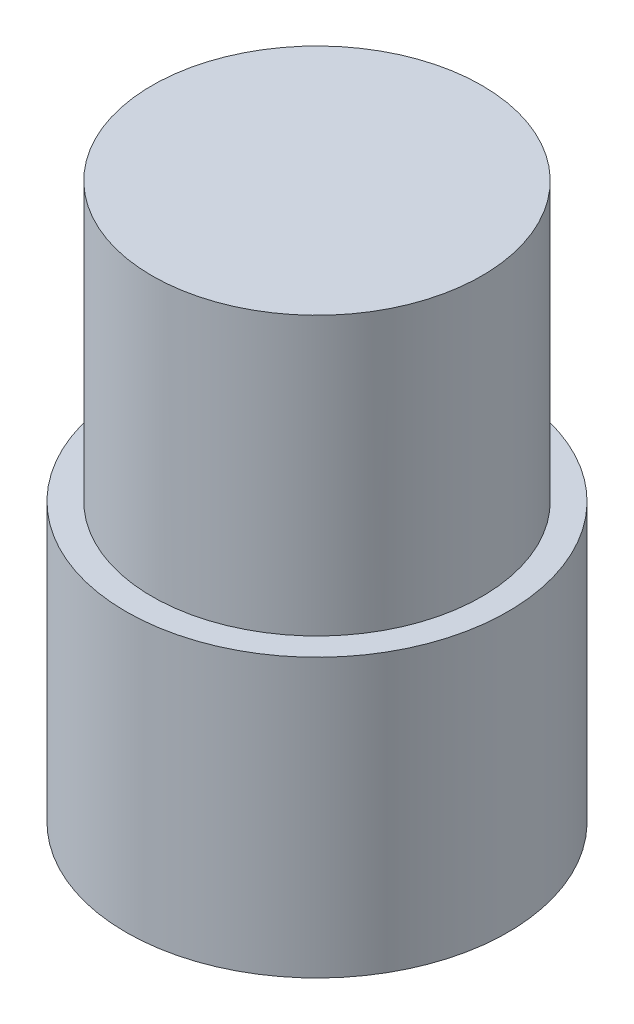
ISO-10303-21;
HEADER;
FILE_DESCRIPTION(('STEP AP214'),'2;1');
FILE_NAME('part.step','',(''),(''),'','','');
FILE_SCHEMA(('AUTOMOTIVE_DESIGN { 1 0 10303 214 1 1 1 1 }'));
ENDSEC;
DATA;
#1=APPLICATION_CONTEXT('core data for automotive mechanical design processes');
#2=APPLICATION_PROTOCOL_DEFINITION('international standard','automotive_design',2000,#1);
#3=PRODUCT_CONTEXT('',#1,'mechanical');
#4=PRODUCT('Part','Part','',(#3));
#5=PRODUCT_RELATED_PRODUCT_CATEGORY('part','',(#4));
#6=PRODUCT_DEFINITION_FORMATION('','',#4);
#7=PRODUCT_DEFINITION_CONTEXT('part definition',#1,'design');
#8=PRODUCT_DEFINITION('design','',#6,#7);
#9=PRODUCT_DEFINITION_SHAPE('','',#8);
#10=(LENGTH_UNIT() NAMED_UNIT(*) SI_UNIT(.MILLI.,.METRE.));
#11=(NAMED_UNIT(*) PLANE_ANGLE_UNIT() SI_UNIT($,.RADIAN.));
#12=(NAMED_UNIT(*) SI_UNIT($,.STERADIAN.) SOLID_ANGLE_UNIT());
#13=UNCERTAINTY_MEASURE_WITH_UNIT(LENGTH_MEASURE(1.E-05),#10,'distance_accuracy_value','');
#14=(GEOMETRIC_REPRESENTATION_CONTEXT(3) GLOBAL_UNCERTAINTY_ASSIGNED_CONTEXT((#13)) GLOBAL_UNIT_ASSIGNED_CONTEXT((#10,
#11,#12)) REPRESENTATION_CONTEXT('',''));
#15=CARTESIAN_POINT('',(0.,0.,0.));
#16=DIRECTION('',(0.,0.,1.));
#17=DIRECTION('',(1.,0.,0.));
#18=AXIS2_PLACEMENT_3D('',#15,#16,#17);
#19=CARTESIAN_POINT('',(0.,2.032,0.));
#20=DIRECTION('',(0.,-1.,0.));
#21=DIRECTION('',(0.,0.,-1.));
#22=AXIS2_PLACEMENT_3D('',#19,#20,#21);
#23=CYLINDRICAL_SURFACE('',#22,1.2065);
#24=CARTESIAN_POINT('',(0.,2.032,0.));
#25=DIRECTION('',(0.,1.,0.));
#26=DIRECTION('',(0.,0.,1.));
#27=AXIS2_PLACEMENT_3D('',#24,#25,#26);
#28=CIRCLE('',#27,1.2065);
#29=CARTESIAN_POINT('',(0.,2.032,1.2065));
#30=VERTEX_POINT('',#29);
#31=EDGE_CURVE('E10',#30,#30,#28,.T.);
#32=ORIENTED_EDGE('',*,*,#31,.F.);
#33=EDGE_LOOP('',(#32));
#34=FACE_BOUND('',#33,.T.);
#35=CARTESIAN_POINT('',(0.,0.,0.));
#36=DIRECTION('',(0.,-1.,0.));
#37=DIRECTION('',(0.,0.,-1.));
#38=AXIS2_PLACEMENT_3D('',#35,#36,#37);
#39=CIRCLE('',#38,1.2065);
#40=CARTESIAN_POINT('',(0.,0.,-1.2065));
#41=VERTEX_POINT('',#40);
#42=EDGE_CURVE('E39',#41,#41,#39,.T.);
#43=ORIENTED_EDGE('',*,*,#42,.F.);
#44=EDGE_LOOP('',(#43));
#45=FACE_BOUND('',#44,.T.);
#46=ADVANCED_FACE('F33',(#34,#45),#23,.T.);
#47=CARTESIAN_POINT('',(0.,2.032,0.));
#48=DIRECTION('',(0.,1.,0.));
#49=DIRECTION('',(0.,0.,1.));
#50=AXIS2_PLACEMENT_3D('',#47,#48,#49);
#51=PLANE('',#50);
#52=ORIENTED_EDGE('',*,*,#31,.T.);
#53=EDGE_LOOP('',(#52));
#54=FACE_BOUND('',#53,.T.);
#55=ADVANCED_FACE('F57',(#54),#51,.T.);
#56=CARTESIAN_POINT('',(0.,0.,0.));
#57=DIRECTION('',(0.,-1.,0.));
#58=DIRECTION('',(0.,0.,-1.));
#59=AXIS2_PLACEMENT_3D('',#56,#57,#58);
#60=PLANE('',#59);
#61=CARTESIAN_POINT('',(0.,0.,0.));
#62=DIRECTION('',(0.,-1.,0.));
#63=DIRECTION('',(0.,0.,-1.));
#64=AXIS2_PLACEMENT_3D('',#61,#62,#63);
#65=CIRCLE('',#64,1.397);
#66=CARTESIAN_POINT('',(0.,0.,-1.397));
#67=VERTEX_POINT('',#66);
#68=EDGE_CURVE('E47',#67,#67,#65,.T.);
#69=ORIENTED_EDGE('',*,*,#68,.F.);
#70=EDGE_LOOP('',(#69));
#71=FACE_BOUND('',#70,.T.);
#72=ORIENTED_EDGE('',*,*,#42,.T.);
#73=EDGE_LOOP('',(#72));
#74=FACE_BOUND('',#73,.T.);
#75=ADVANCED_FACE('F55',(#71,#74),#60,.F.);
#76=CARTESIAN_POINT('',(0.,-2.032,0.));
#77=DIRECTION('',(0.,1.,0.));
#78=DIRECTION('',(0.,0.,1.));
#79=AXIS2_PLACEMENT_3D('',#76,#77,#78);
#80=CYLINDRICAL_SURFACE('',#79,1.397);
#81=CARTESIAN_POINT('',(0.,-2.032,0.));
#82=DIRECTION('',(0.,-1.,0.));
#83=DIRECTION('',(0.,0.,-1.));
#84=AXIS2_PLACEMENT_3D('',#81,#82,#83);
#85=CIRCLE('',#84,1.397);
#86=CARTESIAN_POINT('',(0.,-2.032,-1.397));
#87=VERTEX_POINT('',#86);
#88=EDGE_CURVE('E43',#87,#87,#85,.T.);
#89=ORIENTED_EDGE('',*,*,#88,.F.);
#90=EDGE_LOOP('',(#89));
#91=FACE_BOUND('',#90,.T.);
#92=ORIENTED_EDGE('',*,*,#68,.T.);
#93=EDGE_LOOP('',(#92));
#94=FACE_BOUND('',#93,.T.);
#95=ADVANCED_FACE('F53',(#91,#94),#80,.T.);
#96=CARTESIAN_POINT('',(0.,-2.032,0.));
#97=DIRECTION('',(0.,-1.,0.));
#98=DIRECTION('',(0.,0.,-1.));
#99=AXIS2_PLACEMENT_3D('',#96,#97,#98);
#100=PLANE('',#99);
#101=ORIENTED_EDGE('',*,*,#88,.T.);
#102=EDGE_LOOP('',(#101));
#103=FACE_BOUND('',#102,.T.);
#104=ADVANCED_FACE('F63',(#103),#100,.T.);
#105=CLOSED_SHELL('',(#46,#55,#75,#95,#104));
#106=MANIFOLD_SOLID_BREP('B2',#105);
#107=ADVANCED_BREP_SHAPE_REPRESENTATION('',(#18,#106),#14);
#108=SHAPE_DEFINITION_REPRESENTATION(#9,#107);
ENDSEC;
END-ISO-10303-21;
